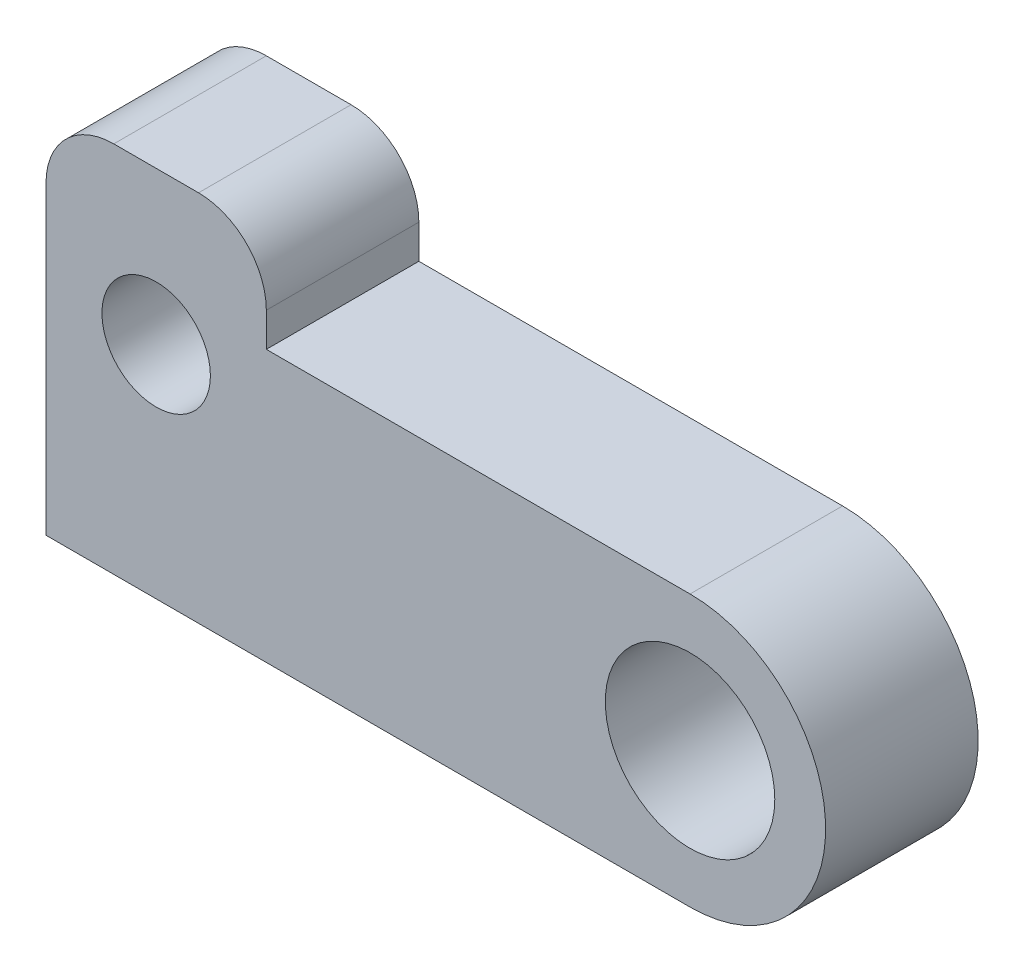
ISO-10303-21;
HEADER;
FILE_DESCRIPTION(('STEP AP214'),'2;1');
FILE_NAME('part.step','',(''),(''),'','','');
FILE_SCHEMA(('AUTOMOTIVE_DESIGN { 1 0 10303 214 1 1 1 1 }'));
ENDSEC;
DATA;
#1=APPLICATION_CONTEXT('core data for automotive mechanical design processes');
#2=APPLICATION_PROTOCOL_DEFINITION('international standard','automotive_design',2000,#1);
#3=PRODUCT_CONTEXT('',#1,'mechanical');
#4=PRODUCT('Part','Part','',(#3));
#5=PRODUCT_RELATED_PRODUCT_CATEGORY('part','',(#4));
#6=PRODUCT_DEFINITION_FORMATION('','',#4);
#7=PRODUCT_DEFINITION_CONTEXT('part definition',#1,'design');
#8=PRODUCT_DEFINITION('design','',#6,#7);
#9=PRODUCT_DEFINITION_SHAPE('','',#8);
#10=(LENGTH_UNIT() NAMED_UNIT(*) SI_UNIT(.MILLI.,.METRE.));
#11=(NAMED_UNIT(*) PLANE_ANGLE_UNIT() SI_UNIT($,.RADIAN.));
#12=(NAMED_UNIT(*) SI_UNIT($,.STERADIAN.) SOLID_ANGLE_UNIT());
#13=UNCERTAINTY_MEASURE_WITH_UNIT(LENGTH_MEASURE(1.E-05),#10,'distance_accuracy_value','');
#14=(GEOMETRIC_REPRESENTATION_CONTEXT(3) GLOBAL_UNCERTAINTY_ASSIGNED_CONTEXT((#13)) GLOBAL_UNIT_ASSIGNED_CONTEXT((#10,
#11,#12)) REPRESENTATION_CONTEXT('',''));
#15=CARTESIAN_POINT('',(0.,0.,0.));
#16=DIRECTION('',(0.,0.,1.));
#17=DIRECTION('',(1.,0.,0.));
#18=AXIS2_PLACEMENT_3D('',#15,#16,#17);
#19=CARTESIAN_POINT('',(4.5,-2.,4.5));
#20=DIRECTION('',(0.,0.,1.));
#21=DIRECTION('',(1.,0.,0.));
#22=AXIS2_PLACEMENT_3D('',#19,#20,#21);
#23=PLANE('',#22);
#24=CARTESIAN_POINT('',(19.,-7.,4.5));
#25=DIRECTION('',(0.,0.,1.));
#26=DIRECTION('',(1.,0.,0.));
#27=AXIS2_PLACEMENT_3D('',#24,#25,#26);
#28=CIRCLE('',#27,2.5);
#29=CARTESIAN_POINT('',(21.5,-7.,4.5));
#30=VERTEX_POINT('',#29);
#31=EDGE_CURVE('E135',#30,#30,#28,.T.);
#32=ORIENTED_EDGE('',*,*,#31,.F.);
#33=EDGE_LOOP('',(#32));
#34=FACE_BOUND('',#33,.T.);
#35=CARTESIAN_POINT('',(4.5,-2.,4.5));
#36=DIRECTION('',(0.,0.,1.));
#37=DIRECTION('',(1.,0.,0.));
#38=AXIS2_PLACEMENT_3D('',#35,#36,#37);
#39=CIRCLE('',#38,2.);
#40=CARTESIAN_POINT('',(6.5,-2.00000000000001,4.5));
#41=VERTEX_POINT('',#40);
#42=CARTESIAN_POINT('',(4.49999999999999,0.,4.5));
#43=VERTEX_POINT('',#42);
#44=EDGE_CURVE('E146',#41,#43,#39,.T.);
#45=ORIENTED_EDGE('',*,*,#44,.T.);
#46=DIRECTION('',(-1.,0.,0.));
#47=VECTOR('',#46,1.);
#48=CARTESIAN_POINT('',(2.00000000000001,0.,4.5));
#49=LINE('',#48,#47);
#50=CARTESIAN_POINT('',(2.00000000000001,0.,4.5));
#51=VERTEX_POINT('',#50);
#52=EDGE_CURVE('E94',#43,#51,#49,.T.);
#53=ORIENTED_EDGE('',*,*,#52,.T.);
#54=CARTESIAN_POINT('',(2.,-2.,4.5));
#55=DIRECTION('',(0.,0.,1.));
#56=DIRECTION('',(1.,0.,0.));
#57=AXIS2_PLACEMENT_3D('',#54,#55,#56);
#58=CIRCLE('',#57,2.);
#59=CARTESIAN_POINT('',(0.,-2.00000000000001,4.5));
#60=VERTEX_POINT('',#59);
#61=EDGE_CURVE('E161',#51,#60,#58,.T.);
#62=ORIENTED_EDGE('',*,*,#61,.T.);
#63=DIRECTION('',(0.,-1.,0.));
#64=VECTOR('',#63,1.);
#65=CARTESIAN_POINT('',(0.,-2.00000000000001,4.5));
#66=LINE('',#65,#64);
#67=CARTESIAN_POINT('',(0.,-11.,4.5));
#68=VERTEX_POINT('',#67);
#69=EDGE_CURVE('E174',#60,#68,#66,.T.);
#70=ORIENTED_EDGE('',*,*,#69,.T.);
#71=DIRECTION('',(1.,0.,0.));
#72=VECTOR('',#71,1.);
#73=CARTESIAN_POINT('',(0.,-11.,4.5));
#74=LINE('',#73,#72);
#75=CARTESIAN_POINT('',(19.,-11.,4.5));
#76=VERTEX_POINT('',#75);
#77=EDGE_CURVE('E113',#68,#76,#74,.T.);
#78=ORIENTED_EDGE('',*,*,#77,.T.);
#79=CARTESIAN_POINT('',(19.,-7.,4.5));
#80=DIRECTION('',(0.,0.,1.));
#81=DIRECTION('',(1.,0.,0.));
#82=AXIS2_PLACEMENT_3D('',#79,#80,#81);
#83=CIRCLE('',#82,4.);
#84=CARTESIAN_POINT('',(19.,-3.,4.5));
#85=VERTEX_POINT('',#84);
#86=EDGE_CURVE('E107',#76,#85,#83,.T.);
#87=ORIENTED_EDGE('',*,*,#86,.T.);
#88=DIRECTION('',(-1.,0.,0.));
#89=VECTOR('',#88,1.);
#90=CARTESIAN_POINT('',(6.5,-3.,4.5));
#91=LINE('',#90,#89);
#92=CARTESIAN_POINT('',(6.5,-3.,4.5));
#93=VERTEX_POINT('',#92);
#94=EDGE_CURVE('E111',#85,#93,#91,.T.);
#95=ORIENTED_EDGE('',*,*,#94,.T.);
#96=DIRECTION('',(0.,1.,0.));
#97=VECTOR('',#96,1.);
#98=CARTESIAN_POINT('',(6.5,-2.00000000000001,4.5));
#99=LINE('',#98,#97);
#100=EDGE_CURVE('E51',#93,#41,#99,.T.);
#101=ORIENTED_EDGE('',*,*,#100,.T.);
#102=EDGE_LOOP('',(#45,#53,#62,#70,#78,#87,#95,#101));
#103=FACE_BOUND('',#102,.T.);
#104=CARTESIAN_POINT('',(3.25,-4.5,4.5));
#105=DIRECTION('',(0.,0.,1.));
#106=DIRECTION('',(1.,0.,0.));
#107=AXIS2_PLACEMENT_3D('',#104,#105,#106);
#108=CIRCLE('',#107,1.6);
#109=CARTESIAN_POINT('',(4.85,-4.5,4.5));
#110=VERTEX_POINT('',#109);
#111=EDGE_CURVE('E183',#110,#110,#108,.T.);
#112=ORIENTED_EDGE('',*,*,#111,.F.);
#113=EDGE_LOOP('',(#112));
#114=FACE_BOUND('',#113,.T.);
#115=ADVANCED_FACE('F34',(#34,#103,#114),#23,.T.);
#116=CARTESIAN_POINT('',(4.5,-2.,0.));
#117=DIRECTION('',(0.,0.,1.));
#118=DIRECTION('',(1.,0.,0.));
#119=AXIS2_PLACEMENT_3D('',#116,#117,#118);
#120=PLANE('',#119);
#121=CARTESIAN_POINT('',(19.,-7.,0.));
#122=DIRECTION('',(0.,0.,1.));
#123=DIRECTION('',(1.,0.,0.));
#124=AXIS2_PLACEMENT_3D('',#121,#122,#123);
#125=CIRCLE('',#124,2.5);
#126=CARTESIAN_POINT('',(21.5,-7.,0.));
#127=VERTEX_POINT('',#126);
#128=EDGE_CURVE('E180',#127,#127,#125,.T.);
#129=ORIENTED_EDGE('',*,*,#128,.T.);
#130=EDGE_LOOP('',(#129));
#131=FACE_BOUND('',#130,.T.);
#132=CARTESIAN_POINT('',(4.5,-2.,0.));
#133=DIRECTION('',(0.,0.,1.));
#134=DIRECTION('',(1.,0.,0.));
#135=AXIS2_PLACEMENT_3D('',#132,#133,#134);
#136=CIRCLE('',#135,2.);
#137=CARTESIAN_POINT('',(6.5,-2.00000000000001,0.));
#138=VERTEX_POINT('',#137);
#139=CARTESIAN_POINT('',(4.49999999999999,0.,0.));
#140=VERTEX_POINT('',#139);
#141=EDGE_CURVE('E131',#138,#140,#136,.T.);
#142=ORIENTED_EDGE('',*,*,#141,.F.);
#143=DIRECTION('',(0.,1.,0.));
#144=VECTOR('',#143,1.);
#145=CARTESIAN_POINT('',(6.5,-2.00000000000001,0.));
#146=LINE('',#145,#144);
#147=CARTESIAN_POINT('',(6.5,-3.,0.));
#148=VERTEX_POINT('',#147);
#149=EDGE_CURVE('E86',#148,#138,#146,.T.);
#150=ORIENTED_EDGE('',*,*,#149,.F.);
#151=DIRECTION('',(-1.,0.,0.));
#152=VECTOR('',#151,1.);
#153=CARTESIAN_POINT('',(6.5,-3.,0.));
#154=LINE('',#153,#152);
#155=CARTESIAN_POINT('',(19.,-3.,0.));
#156=VERTEX_POINT('',#155);
#157=EDGE_CURVE('E80',#156,#148,#154,.T.);
#158=ORIENTED_EDGE('',*,*,#157,.F.);
#159=CARTESIAN_POINT('',(19.,-7.,0.));
#160=DIRECTION('',(0.,0.,1.));
#161=DIRECTION('',(1.,0.,0.));
#162=AXIS2_PLACEMENT_3D('',#159,#160,#161);
#163=CIRCLE('',#162,4.);
#164=CARTESIAN_POINT('',(19.,-11.,0.));
#165=VERTEX_POINT('',#164);
#166=EDGE_CURVE('E121',#165,#156,#163,.T.);
#167=ORIENTED_EDGE('',*,*,#166,.F.);
#168=DIRECTION('',(1.,0.,0.));
#169=VECTOR('',#168,1.);
#170=CARTESIAN_POINT('',(0.,-11.,0.));
#171=LINE('',#170,#169);
#172=CARTESIAN_POINT('',(0.,-11.,0.));
#173=VERTEX_POINT('',#172);
#174=EDGE_CURVE('E141',#173,#165,#171,.T.);
#175=ORIENTED_EDGE('',*,*,#174,.F.);
#176=DIRECTION('',(0.,-1.,0.));
#177=VECTOR('',#176,1.);
#178=CARTESIAN_POINT('',(0.,-2.00000000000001,0.));
#179=LINE('',#178,#177);
#180=CARTESIAN_POINT('',(0.,-2.00000000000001,0.));
#181=VERTEX_POINT('',#180);
#182=EDGE_CURVE('E139',#181,#173,#179,.T.);
#183=ORIENTED_EDGE('',*,*,#182,.F.);
#184=CARTESIAN_POINT('',(2.,-2.,0.));
#185=DIRECTION('',(0.,0.,1.));
#186=DIRECTION('',(1.,0.,0.));
#187=AXIS2_PLACEMENT_3D('',#184,#185,#186);
#188=CIRCLE('',#187,2.);
#189=CARTESIAN_POINT('',(2.00000000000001,0.,0.));
#190=VERTEX_POINT('',#189);
#191=EDGE_CURVE('E137',#190,#181,#188,.T.);
#192=ORIENTED_EDGE('',*,*,#191,.F.);
#193=DIRECTION('',(-1.,0.,0.));
#194=VECTOR('',#193,1.);
#195=CARTESIAN_POINT('',(2.00000000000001,0.,0.));
#196=LINE('',#195,#194);
#197=EDGE_CURVE('E134',#140,#190,#196,.T.);
#198=ORIENTED_EDGE('',*,*,#197,.F.);
#199=EDGE_LOOP('',(#142,#150,#158,#167,#175,#183,#192,#198));
#200=FACE_BOUND('',#199,.T.);
#201=CARTESIAN_POINT('',(3.25,-4.5,0.));
#202=DIRECTION('',(0.,0.,1.));
#203=DIRECTION('',(1.,0.,0.));
#204=AXIS2_PLACEMENT_3D('',#201,#202,#203);
#205=CIRCLE('',#204,1.6);
#206=CARTESIAN_POINT('',(4.85,-4.5,0.));
#207=VERTEX_POINT('',#206);
#208=EDGE_CURVE('E186',#207,#207,#205,.T.);
#209=ORIENTED_EDGE('',*,*,#208,.T.);
#210=EDGE_LOOP('',(#209));
#211=FACE_BOUND('',#210,.T.);
#212=ADVANCED_FACE('F165',(#131,#200,#211),#120,.F.);
#213=CARTESIAN_POINT('',(4.5,-2.,4.5));
#214=DIRECTION('',(0.,0.,-1.));
#215=DIRECTION('',(-1.,0.,0.));
#216=AXIS2_PLACEMENT_3D('',#213,#214,#215);
#217=CYLINDRICAL_SURFACE('',#216,2.);
#218=ORIENTED_EDGE('',*,*,#141,.T.);
#219=DIRECTION('',(0.,0.,-1.));
#220=VECTOR('',#219,1.);
#221=CARTESIAN_POINT('',(4.49999999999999,0.,4.5));
#222=LINE('',#221,#220);
#223=EDGE_CURVE('E11',#43,#140,#222,.T.);
#224=ORIENTED_EDGE('',*,*,#223,.F.);
#225=ORIENTED_EDGE('',*,*,#44,.F.);
#226=DIRECTION('',(0.,0.,-1.));
#227=VECTOR('',#226,1.);
#228=CARTESIAN_POINT('',(6.5,-2.00000000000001,4.5));
#229=LINE('',#228,#227);
#230=EDGE_CURVE('E127',#41,#138,#229,.T.);
#231=ORIENTED_EDGE('',*,*,#230,.T.);
#232=EDGE_LOOP('',(#218,#224,#225,#231));
#233=FACE_BOUND('',#232,.T.);
#234=ADVANCED_FACE('F36',(#233),#217,.T.);
#235=CARTESIAN_POINT('',(2.00000000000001,0.,4.5));
#236=DIRECTION('',(0.,-1.,0.));
#237=DIRECTION('',(0.,0.,-1.));
#238=AXIS2_PLACEMENT_3D('',#235,#236,#237);
#239=PLANE('',#238);
#240=ORIENTED_EDGE('',*,*,#197,.T.);
#241=DIRECTION('',(0.,0.,-1.));
#242=VECTOR('',#241,1.);
#243=CARTESIAN_POINT('',(2.00000000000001,0.,4.5));
#244=LINE('',#243,#242);
#245=EDGE_CURVE('E43',#51,#190,#244,.T.);
#246=ORIENTED_EDGE('',*,*,#245,.F.);
#247=ORIENTED_EDGE('',*,*,#52,.F.);
#248=ORIENTED_EDGE('',*,*,#223,.T.);
#249=EDGE_LOOP('',(#240,#246,#247,#248));
#250=FACE_BOUND('',#249,.T.);
#251=ADVANCED_FACE('F219',(#250),#239,.F.);
#252=CARTESIAN_POINT('',(2.,-2.,4.5));
#253=DIRECTION('',(0.,0.,-1.));
#254=DIRECTION('',(-1.,0.,0.));
#255=AXIS2_PLACEMENT_3D('',#252,#253,#254);
#256=CYLINDRICAL_SURFACE('',#255,2.);
#257=ORIENTED_EDGE('',*,*,#191,.T.);
#258=DIRECTION('',(0.,0.,-1.));
#259=VECTOR('',#258,1.);
#260=CARTESIAN_POINT('',(0.,-2.00000000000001,4.5));
#261=LINE('',#260,#259);
#262=EDGE_CURVE('E153',#60,#181,#261,.T.);
#263=ORIENTED_EDGE('',*,*,#262,.F.);
#264=ORIENTED_EDGE('',*,*,#61,.F.);
#265=ORIENTED_EDGE('',*,*,#245,.T.);
#266=EDGE_LOOP('',(#257,#263,#264,#265));
#267=FACE_BOUND('',#266,.T.);
#268=ADVANCED_FACE('F159',(#267),#256,.T.);
#269=CARTESIAN_POINT('',(0.,-2.00000000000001,4.5));
#270=DIRECTION('',(1.,0.,0.));
#271=DIRECTION('',(0.,1.,0.));
#272=AXIS2_PLACEMENT_3D('',#269,#270,#271);
#273=PLANE('',#272);
#274=ORIENTED_EDGE('',*,*,#182,.T.);
#275=DIRECTION('',(0.,0.,-1.));
#276=VECTOR('',#275,1.);
#277=CARTESIAN_POINT('',(0.,-11.,4.5));
#278=LINE('',#277,#276);
#279=EDGE_CURVE('E150',#68,#173,#278,.T.);
#280=ORIENTED_EDGE('',*,*,#279,.F.);
#281=ORIENTED_EDGE('',*,*,#69,.F.);
#282=ORIENTED_EDGE('',*,*,#262,.T.);
#283=EDGE_LOOP('',(#274,#280,#281,#282));
#284=FACE_BOUND('',#283,.T.);
#285=ADVANCED_FACE('F170',(#284),#273,.F.);
#286=CARTESIAN_POINT('',(0.,-11.,4.5));
#287=DIRECTION('',(0.,1.,0.));
#288=DIRECTION('',(0.,0.,1.));
#289=AXIS2_PLACEMENT_3D('',#286,#287,#288);
#290=PLANE('',#289);
#291=ORIENTED_EDGE('',*,*,#174,.T.);
#292=DIRECTION('',(0.,0.,-1.));
#293=VECTOR('',#292,1.);
#294=CARTESIAN_POINT('',(19.,-11.,4.5));
#295=LINE('',#294,#293);
#296=EDGE_CURVE('E122',#76,#165,#295,.T.);
#297=ORIENTED_EDGE('',*,*,#296,.F.);
#298=ORIENTED_EDGE('',*,*,#77,.F.);
#299=ORIENTED_EDGE('',*,*,#279,.T.);
#300=EDGE_LOOP('',(#291,#297,#298,#299));
#301=FACE_BOUND('',#300,.T.);
#302=ADVANCED_FACE('F173',(#301),#290,.F.);
#303=CARTESIAN_POINT('',(19.,-7.,4.5));
#304=DIRECTION('',(0.,0.,-1.));
#305=DIRECTION('',(-1.,0.,0.));
#306=AXIS2_PLACEMENT_3D('',#303,#304,#305);
#307=CYLINDRICAL_SURFACE('',#306,4.);
#308=ORIENTED_EDGE('',*,*,#166,.T.);
#309=DIRECTION('',(0.,0.,-1.));
#310=VECTOR('',#309,1.);
#311=CARTESIAN_POINT('',(19.,-3.,4.5));
#312=LINE('',#311,#310);
#313=EDGE_CURVE('E118',#85,#156,#312,.T.);
#314=ORIENTED_EDGE('',*,*,#313,.F.);
#315=ORIENTED_EDGE('',*,*,#86,.F.);
#316=ORIENTED_EDGE('',*,*,#296,.T.);
#317=EDGE_LOOP('',(#308,#314,#315,#316));
#318=FACE_BOUND('',#317,.T.);
#319=ADVANCED_FACE('F119',(#318),#307,.T.);
#320=CARTESIAN_POINT('',(6.5,-3.,4.5));
#321=DIRECTION('',(0.,-1.,0.));
#322=DIRECTION('',(0.,0.,-1.));
#323=AXIS2_PLACEMENT_3D('',#320,#321,#322);
#324=PLANE('',#323);
#325=ORIENTED_EDGE('',*,*,#157,.T.);
#326=DIRECTION('',(0.,0.,-1.));
#327=VECTOR('',#326,1.);
#328=CARTESIAN_POINT('',(6.5,-3.,4.5));
#329=LINE('',#328,#327);
#330=EDGE_CURVE('E123',#93,#148,#329,.T.);
#331=ORIENTED_EDGE('',*,*,#330,.F.);
#332=ORIENTED_EDGE('',*,*,#94,.F.);
#333=ORIENTED_EDGE('',*,*,#313,.T.);
#334=EDGE_LOOP('',(#325,#331,#332,#333));
#335=FACE_BOUND('',#334,.T.);
#336=ADVANCED_FACE('F125',(#335),#324,.F.);
#337=CARTESIAN_POINT('',(6.5,-2.00000000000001,4.5));
#338=DIRECTION('',(-1.,0.,0.));
#339=DIRECTION('',(0.,0.,1.));
#340=AXIS2_PLACEMENT_3D('',#337,#338,#339);
#341=PLANE('',#340);
#342=ORIENTED_EDGE('',*,*,#149,.T.);
#343=ORIENTED_EDGE('',*,*,#230,.F.);
#344=ORIENTED_EDGE('',*,*,#100,.F.);
#345=ORIENTED_EDGE('',*,*,#330,.T.);
#346=EDGE_LOOP('',(#342,#343,#344,#345));
#347=FACE_BOUND('',#346,.T.);
#348=ADVANCED_FACE('F207',(#347),#341,.F.);
#349=CARTESIAN_POINT('',(19.,-7.,4.5));
#350=DIRECTION('',(0.,0.,-1.));
#351=DIRECTION('',(-1.,0.,0.));
#352=AXIS2_PLACEMENT_3D('',#349,#350,#351);
#353=CYLINDRICAL_SURFACE('',#352,2.5);
#354=ORIENTED_EDGE('',*,*,#31,.T.);
#355=EDGE_LOOP('',(#354));
#356=FACE_BOUND('',#355,.T.);
#357=ORIENTED_EDGE('',*,*,#128,.F.);
#358=EDGE_LOOP('',(#357));
#359=FACE_BOUND('',#358,.T.);
#360=ADVANCED_FACE('F204',(#356,#359),#353,.F.);
#361=CARTESIAN_POINT('',(3.25,-4.5,4.5));
#362=DIRECTION('',(0.,0.,-1.));
#363=DIRECTION('',(-1.,0.,0.));
#364=AXIS2_PLACEMENT_3D('',#361,#362,#363);
#365=CYLINDRICAL_SURFACE('',#364,1.6);
#366=ORIENTED_EDGE('',*,*,#111,.T.);
#367=EDGE_LOOP('',(#366));
#368=FACE_BOUND('',#367,.T.);
#369=ORIENTED_EDGE('',*,*,#208,.F.);
#370=EDGE_LOOP('',(#369));
#371=FACE_BOUND('',#370,.T.);
#372=ADVANCED_FACE('F192',(#368,#371),#365,.F.);
#373=CLOSED_SHELL('',(#115,#212,#234,#251,#268,#285,#302,#319,#336,#348,#360,#372));
#374=MANIFOLD_SOLID_BREP('B2',#373);
#375=ADVANCED_BREP_SHAPE_REPRESENTATION('',(#18,#374),#14);
#376=SHAPE_DEFINITION_REPRESENTATION(#9,#375);
ENDSEC;
END-ISO-10303-21;
